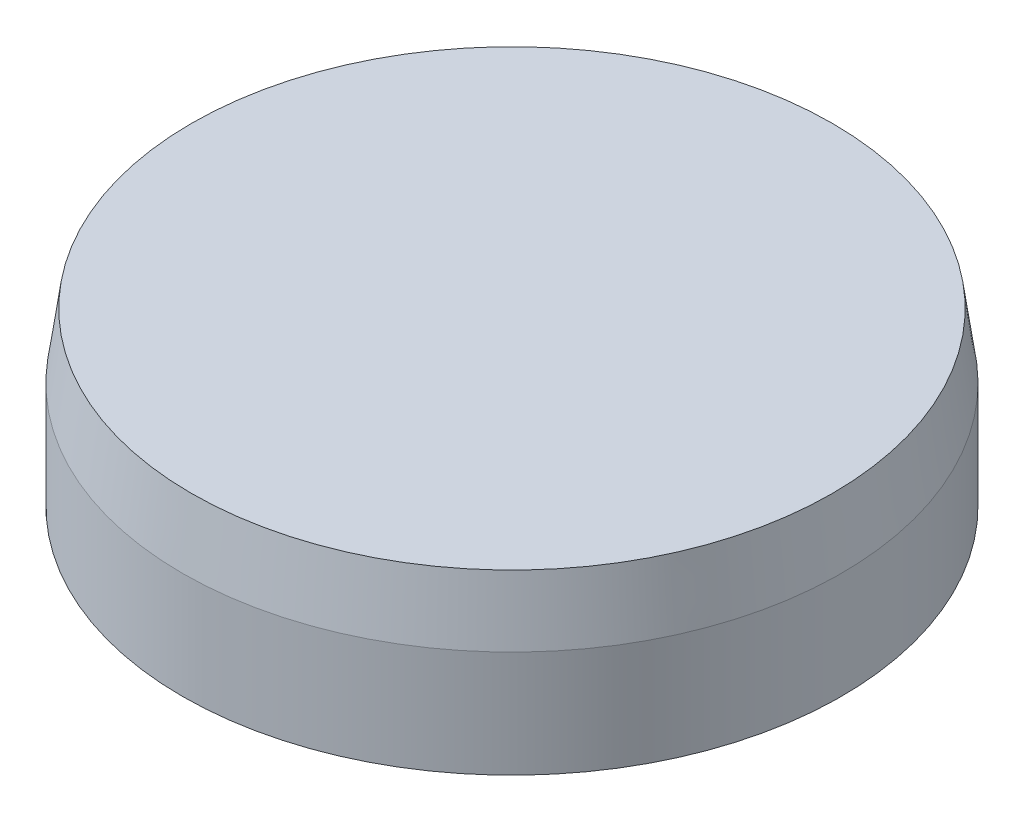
from build123d import *

# Parameters (mm, degrees)
SKETCH1_R      = 12.954
SKETCH1_R_2    = 10.795
EXTRUDE1_DEPTH = 4.191
SKETCH2_R      = 12.954
SKETCH2_R_2    = 10.795
EXTRUDE2_DEPTH = 2.54
EXTRUDE2_DRAFT = 8
SKETCH3_R      = 12.59702628
EXTRUDE3_DEPTH = 1.27


with BuildPart() as part:
    # Sketch1 → Extrude1 (new body)
    with BuildSketch(Plane(origin=(0, 0, 0), x_dir=(1, 0, 0), z_dir=(0, 1, 0))):
        with Locations(Location((0, 0, 0), (0, 0, 270))):
            Circle(SKETCH1_R)
        with Locations(Location((0, 0, 0), (0, 0, 270))):
            Circle(SKETCH1_R_2, mode=Mode.SUBTRACT)
    extrude(amount=EXTRUDE1_DEPTH)


with BuildPart() as extrude2_tool:
    # Sketch2 → Extrude2 (with draft: the straight prism first)
    with BuildSketch(Plane(origin=(0, 4.191, 0), x_dir=(-1, 0, 0), z_dir=(0, 1, 0))):
        with Locations(Location((0, 0, 0), (0, 0, 90))):
            Circle(SKETCH2_R)
        with Locations(Location((0, 0, 0), (0, 0, 90))):
            Circle(SKETCH2_R_2, mode=Mode.SUBTRACT)
    extrude(amount=EXTRUDE2_DEPTH)
    # Extrude2: the draft: its side faces are tilted about the plane it starts from
    extrude2_sides = [extrude2_tool.faces().sort_by_distance(p)[0] for p in [
        (0, 5.461, -12.954),
        (0, 5.461, -10.795),
    ]]
    draft(extrude2_sides, Plane(origin=(0, 4.191, 0), x_dir=(-1, 0, 0), z_dir=(0, 1, 0)), EXTRUDE2_DRAFT)


with BuildPart() as part_1:
    add(part.part)

    # Extrude2: add extrude2_tool
    add(extrude2_tool.part)

    # Sketch3 → Extrude3 (add)
    with BuildSketch(Plane(origin=(0, 6.731, 0), x_dir=(-1, 0, 0), z_dir=(0, 1, 0))):
        Circle(SKETCH3_R)
    extrude(amount=-EXTRUDE3_DEPTH)


solid = part_1.part
